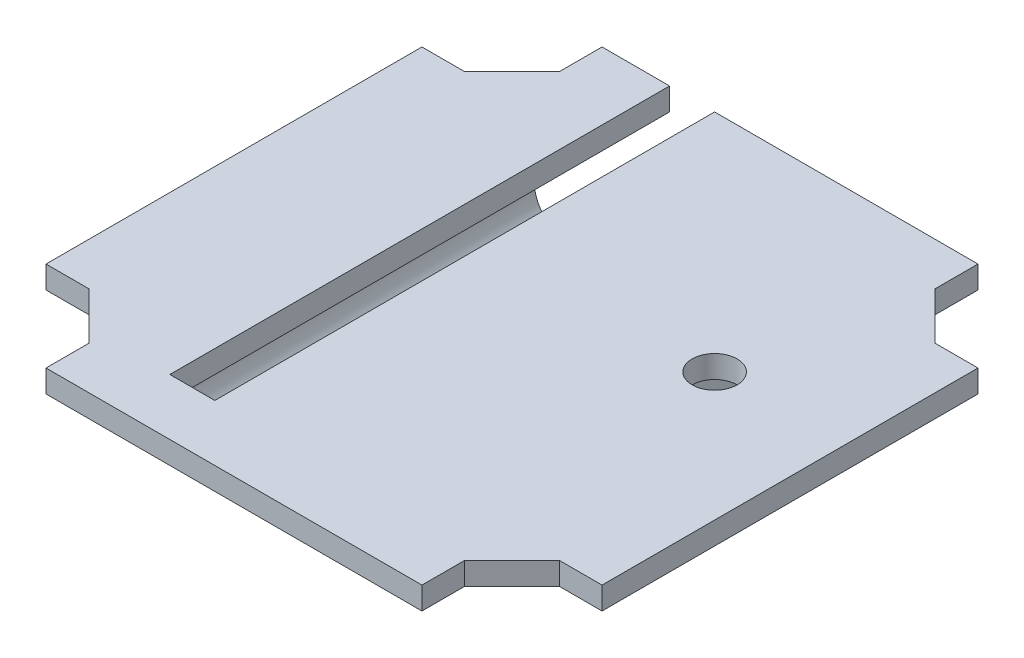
from build123d import *

# Parameters (mm, degrees)
AUFSATZ_LINEAR_AUSTRAGEN1_DEPTH      = 2
AUFSATZ_LINEAR_START                 = -8.5
AUFSATZ_LINEAR_AUSTRAGEN2_DEPTH      = 32.4
VERRUNDUNG1_R                        = 0.2
VERRUNDUNG2_R                        = 1
SCHNITT_LINEAR_AUSTRAGEN1_DEPTH      = 36.835457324
SCHNITT_LINEAR_AUSTRAGEN1_DEPTH_BACK = 36.835457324
SKIZZE5_W                            = 4
SKIZZE5_H                            = 44.4
SCHNITT_LINEAR_AUSTRAGEN2_DEPTH      = 36.835457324
SCHNITT_LINEAR_AUSTRAGEN2_DEPTH_BACK = 36.835457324
SKIZZE6_R                            = 2


with BuildPart() as part:
    # Skizze1 → Aufsatz-Linear austragen1 (new body)
    with BuildSketch(Plane(origin=(0, 0, 0), x_dir=(1, 0, 0), z_dir=(0, 1, 0))):
        Polygon((-24.7, 16.7), (-24.7, -16.7), (-20.9, -16.7), (-16.7, -20.9), (-16.7, -24.7), (16.7, -24.7), (16.7, -20.9), (20.9, -16.7), (24.7, -16.7), (24.7, 16.7), (20.9, 16.7), (16.7, 20.9), (16.7, 24.7), (-16.7, 24.7), (-16.7, 20.9), (-20.9, 16.7), align=None)
    extrude(amount=AUFSATZ_LINEAR_AUSTRAGEN1_DEPTH)

    # Skizze4 → Aufsatz-Linear austragen2 (add)
    with BuildSketch(Plane.XY.offset(24.7).offset(AUFSATZ_LINEAR_START)):
        with BuildLine():
            ThreePointArc((-11.2, -6), (-14.2, -3), (-11.2, 0))
            Line((-11.2, 0), (-15.7, 0))
            Line((-15.7, 0), (-15.7, -6))
            Line((-15.7, -6), (-11.2, -6))
        make_face()
        with BuildLine():
            Line((9.3, -6), (9.3, 0))
            Line((9.3, 0), (4.8, 0))
            ThreePointArc((4.8, 0), (7.8, -3), (4.8, -6))
            Line((4.8, -6), (9.3, -6))
        make_face()
    extrude(amount=-AUFSATZ_LINEAR_AUSTRAGEN2_DEPTH)

    # Verrundung1
    verrundung1_edges = [part.edges().sort_by_distance(p)[0] for p in [
        (-11.2, -6, 0),
        (4.8, -6, 0),
    ]]
    fillet(verrundung1_edges, radius=VERRUNDUNG1_R)

    # Verrundung2
    verrundung2_edges = [part.edges().sort_by_distance(p)[0] for p in [
        (-15.7, 0, 0),
        (9.3, 0, 0),
    ]]
    fillet(verrundung2_edges, radius=VERRUNDUNG2_R)

    # Skizze5 → Schnitt-Linear austragen1 (cut, two sides: drawn at the far end of the back side and taken through both)
    with BuildSketch(Plane(origin=(0, 2, 0), x_dir=(1, 0, 0), z_dir=(0, 1, 0)).offset(-SCHNITT_LINEAR_AUSTRAGEN1_DEPTH_BACK)):
        with Locations((-8.7, 2.5)):
            Rectangle(SKIZZE5_W, SKIZZE5_H)
    extrude(amount=SCHNITT_LINEAR_AUSTRAGEN1_DEPTH + SCHNITT_LINEAR_AUSTRAGEN1_DEPTH_BACK, mode=Mode.SUBTRACT)

    # Skizze6 → Schnitt-Linear austragen2 (cut, two sides: drawn at the far end of the back side and taken through both)
    with BuildSketch(Plane(origin=(0, 2, 0), x_dir=(1, 0, 0), z_dir=(0, 1, 0)).offset(-SCHNITT_LINEAR_AUSTRAGEN2_DEPTH_BACK)):
        with Locations(Location((13.3, 4.7, 0), (0, 0, 270))):
            Circle(SKIZZE6_R)
    extrude(amount=SCHNITT_LINEAR_AUSTRAGEN2_DEPTH + SCHNITT_LINEAR_AUSTRAGEN2_DEPTH_BACK, mode=Mode.SUBTRACT)


solid = part.part
